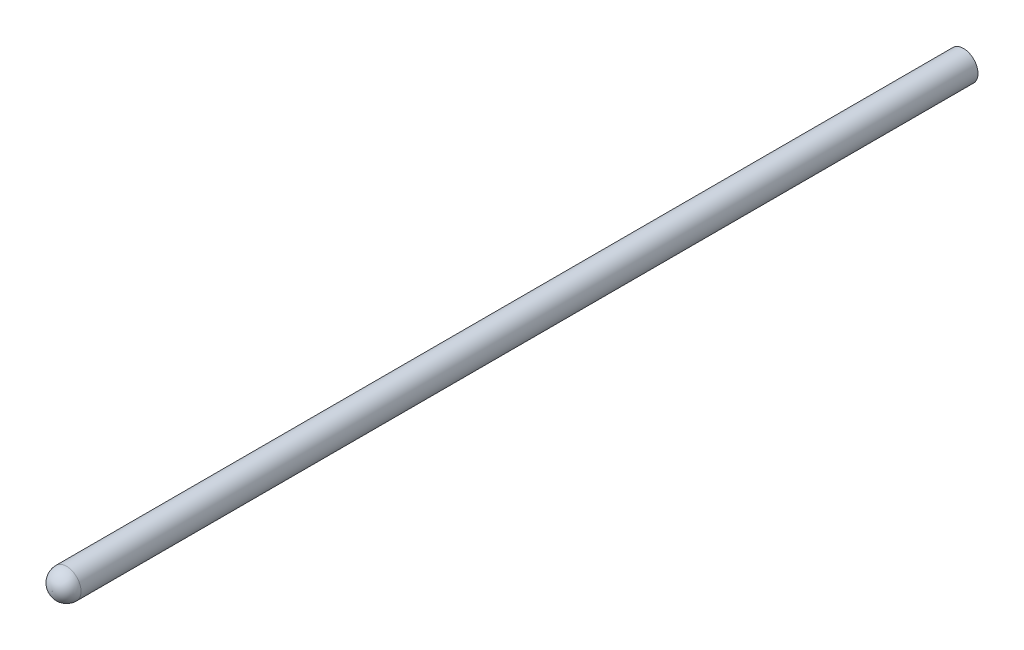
from build123d import *

# Parameters (mm, degrees)
SKETCH2_R           = 3.25
BOSS_EXTRUDE1_DEPTH = 203.2
FILLET1_R           = 3.175


with BuildPart() as part:
    # Sketch2 → Boss-Extrude1 (new body)
    with BuildSketch(Plane.XY):
        Circle(SKETCH2_R)
    extrude(amount=BOSS_EXTRUDE1_DEPTH)

    # Fillet1
    fillet1_edges = [part.edges().sort_by_distance(p)[0] for p in [
        (-3.25, 0, 203.2),
    ]]
    fillet(fillet1_edges, radius=FILLET1_R)


solid = part.part
